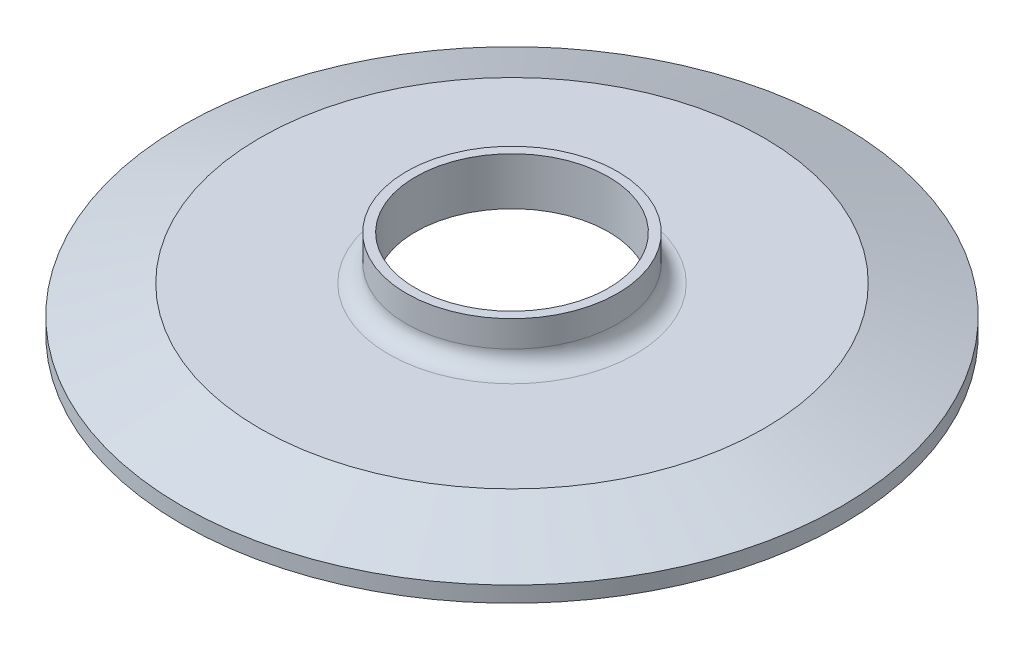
ISO-10303-21;
HEADER;
FILE_DESCRIPTION(('STEP AP214'),'2;1');
FILE_NAME('part.step','',(''),(''),'','','');
FILE_SCHEMA(('AUTOMOTIVE_DESIGN { 1 0 10303 214 1 1 1 1 }'));
ENDSEC;
DATA;
#1=APPLICATION_CONTEXT('core data for automotive mechanical design processes');
#2=APPLICATION_PROTOCOL_DEFINITION('international standard','automotive_design',2000,#1);
#3=PRODUCT_CONTEXT('',#1,'mechanical');
#4=PRODUCT('Part','Part','',(#3));
#5=PRODUCT_RELATED_PRODUCT_CATEGORY('part','',(#4));
#6=PRODUCT_DEFINITION_FORMATION('','',#4);
#7=PRODUCT_DEFINITION_CONTEXT('part definition',#1,'design');
#8=PRODUCT_DEFINITION('design','',#6,#7);
#9=PRODUCT_DEFINITION_SHAPE('','',#8);
#10=(LENGTH_UNIT() NAMED_UNIT(*) SI_UNIT(.MILLI.,.METRE.));
#11=(NAMED_UNIT(*) PLANE_ANGLE_UNIT() SI_UNIT($,.RADIAN.));
#12=(NAMED_UNIT(*) SI_UNIT($,.STERADIAN.) SOLID_ANGLE_UNIT());
#13=UNCERTAINTY_MEASURE_WITH_UNIT(LENGTH_MEASURE(1.E-05),#10,'distance_accuracy_value','');
#14=(GEOMETRIC_REPRESENTATION_CONTEXT(3) GLOBAL_UNCERTAINTY_ASSIGNED_CONTEXT((#13)) GLOBAL_UNIT_ASSIGNED_CONTEXT((#10,
#11,#12)) REPRESENTATION_CONTEXT('',''));
#15=CARTESIAN_POINT('',(0.,0.,0.));
#16=DIRECTION('',(0.,0.,1.));
#17=DIRECTION('',(1.,0.,0.));
#18=AXIS2_PLACEMENT_3D('',#15,#16,#17);
#19=CARTESIAN_POINT('',(-17.399,15.875,0.));
#20=DIRECTION('',(0.,-1.,0.));
#21=DIRECTION('',(0.,0.,-1.));
#22=AXIS2_PLACEMENT_3D('',#19,#20,#21);
#23=PLANE('',#22);
#24=CARTESIAN_POINT('',(0.,15.875,0.));
#25=DIRECTION('',(0.,-1.,0.));
#26=DIRECTION('',(0.,0.,-1.));
#27=AXIS2_PLACEMENT_3D('',#24,#25,#26);
#28=CIRCLE('',#27,19.05);
#29=CARTESIAN_POINT('',(0.,15.875,-19.05));
#30=VERTEX_POINT('',#29);
#31=EDGE_CURVE('E10',#30,#30,#28,.T.);
#32=ORIENTED_EDGE('',*,*,#31,.F.);
#33=EDGE_LOOP('',(#32));
#34=FACE_BOUND('',#33,.T.);
#35=CARTESIAN_POINT('',(0.,15.875,0.));
#36=DIRECTION('',(0.,-1.,0.));
#37=DIRECTION('',(0.,0.,-1.));
#38=AXIS2_PLACEMENT_3D('',#35,#36,#37);
#39=CIRCLE('',#38,17.399);
#40=CARTESIAN_POINT('',(0.,15.875,-17.399));
#41=VERTEX_POINT('',#40);
#42=EDGE_CURVE('E80',#41,#41,#39,.T.);
#43=ORIENTED_EDGE('',*,*,#42,.T.);
#44=EDGE_LOOP('',(#43));
#45=FACE_BOUND('',#44,.T.);
#46=ADVANCED_FACE('F31',(#34,#45),#23,.F.);
#47=CARTESIAN_POINT('',(0.,0.,0.));
#48=DIRECTION('',(0.,-1.,0.));
#49=DIRECTION('',(0.,0.,-1.));
#50=AXIS2_PLACEMENT_3D('',#47,#48,#49);
#51=CYLINDRICAL_SURFACE('',#50,19.05);
#52=CARTESIAN_POINT('',(0.,11.1252,0.));
#53=DIRECTION('',(0.,-1.,0.));
#54=DIRECTION('',(0.,0.,-1.));
#55=AXIS2_PLACEMENT_3D('',#52,#53,#54);
#56=CIRCLE('',#55,19.05);
#57=CARTESIAN_POINT('',(0.,11.1252,-19.05));
#58=VERTEX_POINT('',#57);
#59=EDGE_CURVE('E37',#58,#58,#56,.T.);
#60=ORIENTED_EDGE('',*,*,#59,.F.);
#61=EDGE_LOOP('',(#60));
#62=FACE_BOUND('',#61,.T.);
#63=ORIENTED_EDGE('',*,*,#31,.T.);
#64=EDGE_LOOP('',(#63));
#65=FACE_BOUND('',#64,.T.);
#66=ADVANCED_FACE('F159',(#62,#65),#51,.T.);
#67=CARTESIAN_POINT('',(0.,11.1252,0.));
#68=DIRECTION('',(0.,-1.,0.));
#69=DIRECTION('',(0.,0.,-1.));
#70=AXIS2_PLACEMENT_3D('',#67,#68,#69);
#71=TOROIDAL_SURFACE('',#70,22.225,3.175);
#72=CARTESIAN_POINT('',(0.,7.9502,0.));
#73=DIRECTION('',(0.,-1.,0.));
#74=DIRECTION('',(0.,0.,-1.));
#75=AXIS2_PLACEMENT_3D('',#72,#73,#74);
#76=CIRCLE('',#75,22.225);
#77=CARTESIAN_POINT('',(0.,7.9502,-22.225));
#78=VERTEX_POINT('',#77);
#79=EDGE_CURVE('E41',#78,#78,#76,.T.);
#80=ORIENTED_EDGE('',*,*,#79,.F.);
#81=EDGE_LOOP('',(#80));
#82=FACE_BOUND('',#81,.T.);
#83=ORIENTED_EDGE('',*,*,#59,.T.);
#84=EDGE_LOOP('',(#83));
#85=FACE_BOUND('',#84,.T.);
#86=ADVANCED_FACE('F154',(#82,#85),#71,.F.);
#87=CARTESIAN_POINT('',(-22.225,7.9502,0.));
#88=DIRECTION('',(0.,-1.,0.));
#89=DIRECTION('',(0.,0.,-1.));
#90=AXIS2_PLACEMENT_3D('',#87,#88,#89);
#91=PLANE('',#90);
#92=CARTESIAN_POINT('',(0.,7.9502,0.));
#93=DIRECTION('',(0.,-1.,0.));
#94=DIRECTION('',(0.,0.,-1.));
#95=AXIS2_PLACEMENT_3D('',#92,#93,#94);
#96=CIRCLE('',#95,45.4344287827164);
#97=CARTESIAN_POINT('',(0.,7.9502,-45.4344287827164));
#98=VERTEX_POINT('',#97);
#99=EDGE_CURVE('E45',#98,#98,#96,.T.);
#100=ORIENTED_EDGE('',*,*,#99,.F.);
#101=EDGE_LOOP('',(#100));
#102=FACE_BOUND('',#101,.T.);
#103=ORIENTED_EDGE('',*,*,#79,.T.);
#104=EDGE_LOOP('',(#103));
#105=FACE_BOUND('',#104,.T.);
#106=ADVANCED_FACE('F148',(#102,#105),#91,.F.);
#107=CARTESIAN_POINT('',(0.,7.9502,0.));
#108=DIRECTION('',(0.,-1.,0.));
#109=DIRECTION('',(0.,0.,-1.));
#110=AXIS2_PLACEMENT_3D('',#107,#108,#109);
#111=CONICAL_SURFACE('',#110,45.4344287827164,1.22173047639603);
#112=CARTESIAN_POINT('',(0.,2.8448,0.));
#113=DIRECTION('',(0.,-1.,0.));
#114=DIRECTION('',(0.,0.,-1.));
#115=AXIS2_PLACEMENT_3D('',#112,#113,#114);
#116=CIRCLE('',#115,59.4614);
#117=CARTESIAN_POINT('',(0.,2.8448,-59.4614));
#118=VERTEX_POINT('',#117);
#119=EDGE_CURVE('E50',#118,#118,#116,.T.);
#120=ORIENTED_EDGE('',*,*,#119,.F.);
#121=EDGE_LOOP('',(#120));
#122=FACE_BOUND('',#121,.T.);
#123=ORIENTED_EDGE('',*,*,#99,.T.);
#124=EDGE_LOOP('',(#123));
#125=FACE_BOUND('',#124,.T.);
#126=ADVANCED_FACE('F142',(#122,#125),#111,.T.);
#127=CARTESIAN_POINT('',(0.,0.,0.));
#128=DIRECTION('',(0.,-1.,0.));
#129=DIRECTION('',(0.,0.,-1.));
#130=AXIS2_PLACEMENT_3D('',#127,#128,#129);
#131=CYLINDRICAL_SURFACE('',#130,59.4614);
#132=CARTESIAN_POINT('',(0.,0.,0.));
#133=DIRECTION('',(0.,-1.,0.));
#134=DIRECTION('',(0.,0.,-1.));
#135=AXIS2_PLACEMENT_3D('',#132,#133,#134);
#136=CIRCLE('',#135,59.4614);
#137=CARTESIAN_POINT('',(0.,0.,-59.4614));
#138=VERTEX_POINT('',#137);
#139=EDGE_CURVE('E53',#138,#138,#136,.T.);
#140=ORIENTED_EDGE('',*,*,#139,.F.);
#141=EDGE_LOOP('',(#140));
#142=FACE_BOUND('',#141,.T.);
#143=ORIENTED_EDGE('',*,*,#119,.T.);
#144=EDGE_LOOP('',(#143));
#145=FACE_BOUND('',#144,.T.);
#146=ADVANCED_FACE('F136',(#142,#145),#131,.T.);
#147=CARTESIAN_POINT('',(-59.4614,0.,0.));
#148=DIRECTION('',(0.,1.,0.));
#149=DIRECTION('',(0.,0.,1.));
#150=AXIS2_PLACEMENT_3D('',#147,#148,#149);
#151=PLANE('',#150);
#152=CARTESIAN_POINT('',(0.,0.,0.));
#153=DIRECTION('',(0.,-1.,0.));
#154=DIRECTION('',(0.,0.,-1.));
#155=AXIS2_PLACEMENT_3D('',#152,#153,#154);
#156=CIRCLE('',#155,56.924857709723);
#157=CARTESIAN_POINT('',(0.,0.,-56.924857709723));
#158=VERTEX_POINT('',#157);
#159=EDGE_CURVE('E56',#158,#158,#156,.T.);
#160=ORIENTED_EDGE('',*,*,#159,.F.);
#161=EDGE_LOOP('',(#160));
#162=FACE_BOUND('',#161,.T.);
#163=ORIENTED_EDGE('',*,*,#139,.T.);
#164=EDGE_LOOP('',(#163));
#165=FACE_BOUND('',#164,.T.);
#166=ADVANCED_FACE('F130',(#162,#165),#151,.F.);
#167=CARTESIAN_POINT('',(0.,0.776719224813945,0.));
#168=DIRECTION('',(0.,-1.,0.));
#169=DIRECTION('',(0.,0.,-1.));
#170=AXIS2_PLACEMENT_3D('',#167,#168,#169);
#171=TOROIDAL_SURFACE('',#170,56.7956059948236,0.787400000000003);
#172=CARTESIAN_POINT('',(0.,0.469057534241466,0.));
#173=DIRECTION('',(0.,-1.,0.));
#174=DIRECTION('',(0.,0.,-1.));
#175=AXIS2_PLACEMENT_3D('',#172,#173,#174);
#176=CIRCLE('',#175,56.0708004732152);
#177=CARTESIAN_POINT('',(0.,0.469057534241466,-56.0708004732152));
#178=VERTEX_POINT('',#177);
#179=EDGE_CURVE('E59',#178,#178,#176,.T.);
#180=ORIENTED_EDGE('',*,*,#179,.F.);
#181=EDGE_LOOP('',(#180));
#182=FACE_BOUND('',#181,.T.);
#183=ORIENTED_EDGE('',*,*,#159,.T.);
#184=EDGE_LOOP('',(#183));
#185=FACE_BOUND('',#184,.T.);
#186=ADVANCED_FACE('F124',(#182,#185),#171,.T.);
#187=CARTESIAN_POINT('',(0.,0.469057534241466,0.));
#188=DIRECTION('',(0.,-1.,0.));
#189=DIRECTION('',(0.,0.,-1.));
#190=AXIS2_PLACEMENT_3D('',#187,#188,#189);
#191=CONICAL_SURFACE('',#190,56.0708004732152,0.401425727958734);
#192=CARTESIAN_POINT('',(0.,0.872854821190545,0.));
#193=DIRECTION('',(0.,-1.,0.));
#194=DIRECTION('',(0.,0.,-1.));
#195=AXIS2_PLACEMENT_3D('',#192,#193,#194);
#196=CIRCLE('',#195,55.8993986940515);
#197=CARTESIAN_POINT('',(0.,0.872854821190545,-55.8993986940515));
#198=VERTEX_POINT('',#197);
#199=EDGE_CURVE('E62',#198,#198,#196,.T.);
#200=ORIENTED_EDGE('',*,*,#199,.F.);
#201=EDGE_LOOP('',(#200));
#202=FACE_BOUND('',#201,.T.);
#203=ORIENTED_EDGE('',*,*,#179,.T.);
#204=EDGE_LOOP('',(#203));
#205=FACE_BOUND('',#204,.T.);
#206=ADVANCED_FACE('F118',(#202,#205),#191,.F.);
#207=CARTESIAN_POINT('',(0.,0.4064,0.));
#208=DIRECTION('',(0.,-1.,0.));
#209=DIRECTION('',(0.,0.,-1.));
#210=AXIS2_PLACEMENT_3D('',#207,#208,#209);
#211=TOROIDAL_SURFACE('',#210,54.8005,1.1938);
#212=CARTESIAN_POINT('',(0.,0.872854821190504,0.));
#213=DIRECTION('',(0.,-1.,0.));
#214=DIRECTION('',(0.,0.,-1.));
#215=AXIS2_PLACEMENT_3D('',#212,#213,#214);
#216=CIRCLE('',#215,53.7016013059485);
#217=CARTESIAN_POINT('',(0.,0.872854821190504,-53.7016013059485));
#218=VERTEX_POINT('',#217);
#219=EDGE_CURVE('E65',#218,#218,#216,.T.);
#220=ORIENTED_EDGE('',*,*,#219,.F.);
#221=EDGE_LOOP('',(#220));
#222=FACE_BOUND('',#221,.T.);
#223=ORIENTED_EDGE('',*,*,#199,.T.);
#224=EDGE_LOOP('',(#223));
#225=FACE_BOUND('',#224,.T.);
#226=ADVANCED_FACE('F112',(#222,#225),#211,.F.);
#227=CARTESIAN_POINT('',(0.,0.872854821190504,0.));
#228=DIRECTION('',(0.,1.,0.));
#229=DIRECTION('',(0.,0.,1.));
#230=AXIS2_PLACEMENT_3D('',#227,#228,#229);
#231=CONICAL_SURFACE('',#230,53.7016013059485,0.401425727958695);
#232=CARTESIAN_POINT('',(0.,0.479738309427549,0.));
#233=DIRECTION('',(0.,-1.,0.));
#234=DIRECTION('',(0.,0.,-1.));
#235=AXIS2_PLACEMENT_3D('',#232,#233,#234);
#236=CIRCLE('',#235,53.5347332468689);
#237=CARTESIAN_POINT('',(0.,0.479738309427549,-53.5347332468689));
#238=VERTEX_POINT('',#237);
#239=EDGE_CURVE('E68',#238,#238,#236,.T.);
#240=ORIENTED_EDGE('',*,*,#239,.F.);
#241=EDGE_LOOP('',(#240));
#242=FACE_BOUND('',#241,.T.);
#243=ORIENTED_EDGE('',*,*,#219,.T.);
#244=EDGE_LOOP('',(#243));
#245=FACE_BOUND('',#244,.T.);
#246=ADVANCED_FACE('F106',(#242,#245),#231,.T.);
#247=CARTESIAN_POINT('',(0.,0.787400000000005,0.));
#248=DIRECTION('',(0.,-1.,0.));
#249=DIRECTION('',(0.,0.,-1.));
#250=AXIS2_PLACEMENT_3D('',#247,#248,#249);
#251=TOROIDAL_SURFACE('',#250,52.8099277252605,0.787399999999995);
#252=CARTESIAN_POINT('',(0.,0.,0.));
#253=DIRECTION('',(0.,-1.,0.));
#254=DIRECTION('',(0.,0.,-1.));
#255=AXIS2_PLACEMENT_3D('',#252,#253,#254);
#256=CIRCLE('',#255,52.8099277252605);
#257=CARTESIAN_POINT('',(0.,0.,-52.8099277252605));
#258=VERTEX_POINT('',#257);
#259=EDGE_CURVE('E71',#258,#258,#256,.T.);
#260=ORIENTED_EDGE('',*,*,#259,.F.);
#261=EDGE_LOOP('',(#260));
#262=FACE_BOUND('',#261,.T.);
#263=ORIENTED_EDGE('',*,*,#239,.T.);
#264=EDGE_LOOP('',(#263));
#265=FACE_BOUND('',#264,.T.);
#266=ADVANCED_FACE('F100',(#262,#265),#251,.T.);
#267=CARTESIAN_POINT('',(-48.6918,0.,0.));
#268=DIRECTION('',(0.,1.,0.));
#269=DIRECTION('',(0.,0.,1.));
#270=AXIS2_PLACEMENT_3D('',#267,#268,#269);
#271=PLANE('',#270);
#272=CARTESIAN_POINT('',(0.,0.,0.));
#273=DIRECTION('',(0.,-1.,0.));
#274=DIRECTION('',(0.,0.,-1.));
#275=AXIS2_PLACEMENT_3D('',#272,#273,#274);
#276=CIRCLE('',#275,48.6918);
#277=CARTESIAN_POINT('',(0.,0.,-48.6918));
#278=VERTEX_POINT('',#277);
#279=EDGE_CURVE('E74',#278,#278,#276,.T.);
#280=ORIENTED_EDGE('',*,*,#279,.F.);
#281=EDGE_LOOP('',(#280));
#282=FACE_BOUND('',#281,.T.);
#283=ORIENTED_EDGE('',*,*,#259,.T.);
#284=EDGE_LOOP('',(#283));
#285=FACE_BOUND('',#284,.T.);
#286=ADVANCED_FACE('F94',(#282,#285),#271,.F.);
#287=CARTESIAN_POINT('',(0.,0.,0.));
#288=DIRECTION('',(0.,-1.,0.));
#289=DIRECTION('',(0.,0.,-1.));
#290=AXIS2_PLACEMENT_3D('',#287,#288,#289);
#291=CONICAL_SURFACE('',#290,48.6918,1.34215819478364);
#292=CARTESIAN_POINT('',(0.,7.28206267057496,0.));
#293=DIRECTION('',(0.,-1.,0.));
#294=DIRECTION('',(0.,0.,-1.));
#295=AXIS2_PLACEMENT_3D('',#292,#293,#294);
#296=CIRCLE('',#295,17.399);
#297=CARTESIAN_POINT('',(0.,7.28206267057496,-17.399));
#298=VERTEX_POINT('',#297);
#299=EDGE_CURVE('E77',#298,#298,#296,.T.);
#300=ORIENTED_EDGE('',*,*,#299,.F.);
#301=EDGE_LOOP('',(#300));
#302=FACE_BOUND('',#301,.T.);
#303=ORIENTED_EDGE('',*,*,#279,.T.);
#304=EDGE_LOOP('',(#303));
#305=FACE_BOUND('',#304,.T.);
#306=ADVANCED_FACE('F88',(#302,#305),#291,.F.);
#307=CARTESIAN_POINT('',(0.,0.,0.));
#308=DIRECTION('',(0.,-1.,0.));
#309=DIRECTION('',(0.,0.,-1.));
#310=AXIS2_PLACEMENT_3D('',#307,#308,#309);
#311=CYLINDRICAL_SURFACE('',#310,17.399);
#312=ORIENTED_EDGE('',*,*,#42,.F.);
#313=EDGE_LOOP('',(#312));
#314=FACE_BOUND('',#313,.T.);
#315=ORIENTED_EDGE('',*,*,#299,.T.);
#316=EDGE_LOOP('',(#315));
#317=FACE_BOUND('',#316,.T.);
#318=ADVANCED_FACE('F85',(#314,#317),#311,.F.);
#319=CLOSED_SHELL('',(#46,#66,#86,#106,#126,#146,#166,#186,#206,#226,#246,#266,#286,#306,#318));
#320=MANIFOLD_SOLID_BREP('B2',#319);
#321=ADVANCED_BREP_SHAPE_REPRESENTATION('',(#18,#320),#14);
#322=SHAPE_DEFINITION_REPRESENTATION(#9,#321);
ENDSEC;
END-ISO-10303-21;
